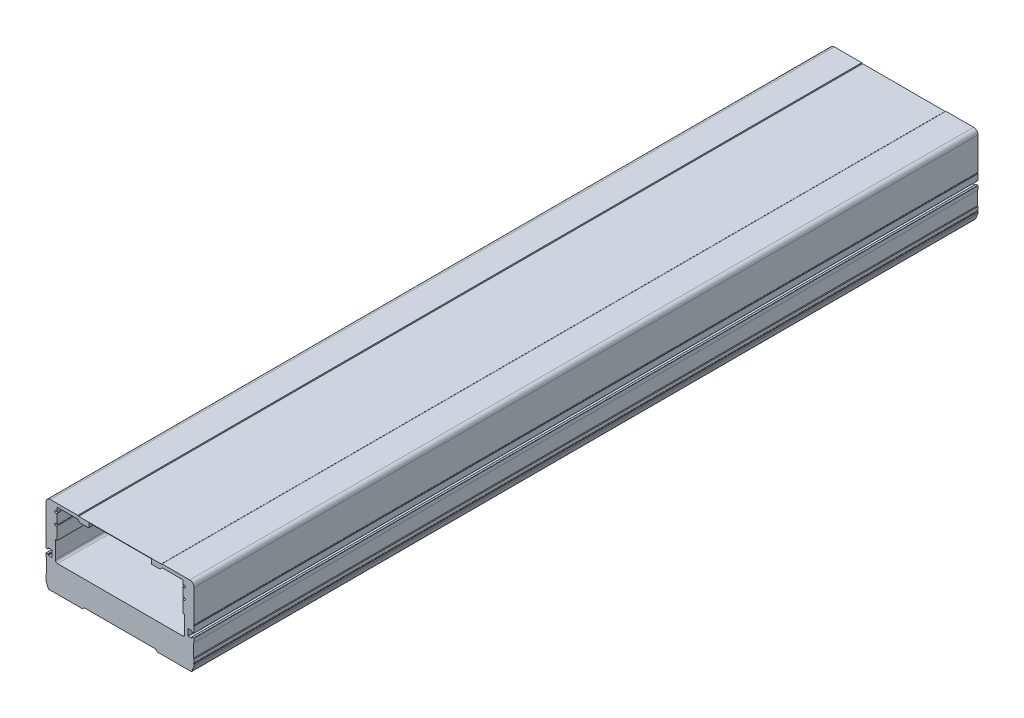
from build123d import *

# Parameters (mm, degrees)
EXTRUDE_1_DEPTH        = 715
HOLE_WIZARD_M6_1_D     = 5
HOLE_WIZARD_M6_1_DEPTH = 12
HOLE_WIZARD_M6_1_TIP   = 1.502151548


with BuildPart() as part:
    # Sketch 1 → Extrude 1 (new body)
    with BuildSketch(Plane.XY):
        with BuildLine():
            Line((-67.5, 66.1), (-67.5, 36.604669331))
            ThreePointArc((-67.5, 36.604669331), (-67.454950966, 36.446555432), (-67.3333333, 36.33592739))
            ThreePointArc((-67.3333333, 36.33592739), (-67.125, 35.999999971), (-67.333333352, 35.664072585))
            ThreePointArc((-67.333333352, 35.664072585), (-67.454950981, 35.553444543), (-67.5, 35.395330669))
            Line((-67.5, 35.395330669), (-67.5, 30.1))
            ThreePointArc((-67.5, 30.1), (-67.412132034, 29.887867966), (-67.2, 29.8))
            Line((-67.2, 29.8), (-65.8, 29.8))
            ThreePointArc((-65.8, 29.8), (-65.587867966, 29.887867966), (-65.5, 30.1))
            Line((-65.5, 30.1), (-65.5, 30.7))
            ThreePointArc((-65.5, 30.7), (-65.412132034, 30.912132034), (-65.2, 31))
            Line((-65.2, 31), (-62.3, 31))
            ThreePointArc((-62.3, 31), (-62.087867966, 30.912132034), (-62, 30.7))
            Line((-62, 30.7), (-62, 25.3))
            ThreePointArc((-62, 25.3), (-62.087867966, 25.087867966), (-62.3, 25))
            Line((-62.3, 25), (-65.2, 25))
            ThreePointArc((-65.2, 25), (-65.412132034, 25.087867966), (-65.5, 25.3))
            Line((-65.5, 25.3), (-65.5, 25.9))
            ThreePointArc((-65.5, 25.9), (-65.587867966, 26.112132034), (-65.8, 26.2))
            Line((-65.8, 26.2), (-67.2, 26.2))
            ThreePointArc((-67.2, 26.2), (-67.412132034, 26.112132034), (-67.5, 25.9))
            Line((-67.5, 25.9), (-67.5, 22.5))
            Line((-67.5, 22.5), (-67, 22))
            Line((-67, 22), (-67, 10))
            Line((-67, 10), (-67.5, 9.5))
            Line((-67.5, 9.5), (-67.5, 6.604669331))
            ThreePointArc((-67.5, 6.604669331), (-67.454950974, 6.446555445), (-67.333333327, 6.335927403))
            ThreePointArc((-67.333333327, 6.335927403), (-67.125, 5.999999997), (-67.333333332, 5.664072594))
            ThreePointArc((-67.333333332, 5.664072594), (-67.454950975, 5.553444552), (-67.5, 5.395330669))
            Line((-67.5, 5.395330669), (-67.5, 4.381968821))
            ThreePointArc((-67.5, 4.381968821), (-67.464493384, 4.00678121), (-67.359234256, 3.644915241))
            Line((-67.359234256, 3.644915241), (-65.506419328, -1.028852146))
            ThreePointArc((-65.506419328, -1.028852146), (-65.35722349, -1.328991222), (-65.16, -1.6))
            Line((-65.16, -1.6), (-34.1, -1.6))
            Line((-34.1, -1.6), (-32.5, 0))
            Line((-32.5, 0), (32.5, 0))
            Line((32.5, 0), (34.1, -1.6))
            Line((34.1, -1.6), (65.16, -1.6))
            ThreePointArc((65.16, -1.6), (65.35722349, -1.328991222), (65.506419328, -1.028852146))
            Line((65.506419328, -1.028852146), (67.359234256, 3.644915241))
            ThreePointArc((67.359234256, 3.644915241), (67.464493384, 4.00678121), (67.5, 4.381968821))
            Line((67.5, 4.381968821), (67.5, 5.395330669))
            ThreePointArc((67.5, 5.395330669), (67.454950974, 5.553444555), (67.333333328, 5.664072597))
            ThreePointArc((67.333333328, 5.664072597), (67.125, 6.000000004), (67.333333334, 6.335927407))
            ThreePointArc((67.333333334, 6.335927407), (67.454950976, 6.446555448), (67.5, 6.604669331))
            Line((67.5, 6.604669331), (67.5, 9.5))
            Line((67.5, 9.5), (67, 10))
            Line((67, 10), (67, 22))
            Line((67, 22), (67.5, 22.5))
            Line((67.5, 22.5), (67.5, 25.9))
            ThreePointArc((67.5, 25.9), (67.412132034, 26.112132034), (67.2, 26.2))
            Line((67.2, 26.2), (65.8, 26.2))
            ThreePointArc((65.8, 26.2), (65.587867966, 26.112132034), (65.5, 25.9))
            Line((65.5, 25.9), (65.5, 25.3))
            ThreePointArc((65.5, 25.3), (65.412132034, 25.087867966), (65.2, 25))
            Line((65.2, 25), (62.3, 25))
            ThreePointArc((62.3, 25), (62.087867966, 25.087867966), (62, 25.3))
            Line((62, 25.3), (62, 30.7))
            ThreePointArc((62, 30.7), (62.087867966, 30.912132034), (62.3, 31))
            Line((62.3, 31), (65.2, 31))
            ThreePointArc((65.2, 31), (65.412132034, 30.912132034), (65.5, 30.7))
            Line((65.5, 30.7), (65.5, 30.1))
            ThreePointArc((65.5, 30.1), (65.587867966, 29.887867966), (65.8, 29.8))
            Line((65.8, 29.8), (67.2, 29.8))
            ThreePointArc((67.2, 29.8), (67.412132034, 29.887867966), (67.5, 30.1))
            Line((67.5, 30.1), (67.5, 35.395330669))
            ThreePointArc((67.5, 35.395330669), (67.454950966, 35.553444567), (67.333333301, 35.66407261))
            ThreePointArc((67.333333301, 35.66407261), (67.125, 36.000000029), (67.333333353, 36.335927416))
            ThreePointArc((67.333333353, 36.335927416), (67.454950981, 36.446555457), (67.5, 36.604669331))
            Line((67.5, 36.604669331), (67.5, 66.1))
            ThreePointArc((67.5, 66.1), (66.328427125, 68.928427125), (63.5, 70.1))
            Line((63.5, 70.1), (38.5, 70.1))
            Line((38.5, 70.1), (38, 69.6))
            Line((38, 69.6), (37.5, 69.6))
            Line((37.5, 69.6), (37.5, 69.7))
            Line((37.5, 69.7), (-37.5, 69.7))
            Line((-37.5, 69.7), (-37.5, 69.6))
            Line((-37.5, 69.6), (-38, 69.6))
            Line((-38, 69.6), (-38.5, 70.1))
            Line((-38.5, 70.1), (-63.5, 70.1))
            ThreePointArc((-63.5, 70.1), (-66.328427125, 68.928427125), (-67.5, 66.1))
        make_face()
        with BuildLine():
            Line((-57, 22.7), (57, 22.7))
            ThreePointArc((57, 22.7), (58.414213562, 23.285786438), (59, 24.7))
            Line((59, 24.7), (59, 40.6))
            Line((59, 40.6), (57.5, 40.6))
            Line((57.5, 40.6), (57.5, 52.141742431))
            ThreePointArc((57.5, 52.141742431), (59.6, 52.6), (57.5, 53.058257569))
            Line((57.5, 53.058257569), (57.5, 62.141742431))
            ThreePointArc((57.5, 62.141742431), (59.6, 62.6), (57.5, 63.058257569))
            Line((57.5, 63.058257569), (57.5, 66.1))
            ThreePointArc((57.5, 66.1), (57.207106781, 66.807106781), (56.5, 67.1))
            Line((56.5, 67.1), (38.5, 67.1))
            Line((38.5, 67.1), (36.5, 65.1))
            Line((36.5, 65.1), (28.8, 65.1))
            ThreePointArc((28.8, 65.1), (28.587867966, 65.187867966), (28.5, 65.4))
            Line((28.5, 65.4), (28.5, 69.3))
            Line((28.5, 69.3), (-28.5, 69.3))
            Line((-28.5, 69.3), (-28.5, 65.4))
            ThreePointArc((-28.5, 65.4), (-28.587867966, 65.187867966), (-28.8, 65.1))
            Line((-28.8, 65.1), (-36.5, 65.1))
            Line((-36.5, 65.1), (-38.5, 67.1))
            Line((-38.5, 67.1), (-56.5, 67.1))
            ThreePointArc((-56.5, 67.1), (-57.207106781, 66.807106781), (-57.5, 66.1))
            Line((-57.5, 66.1), (-57.5, 63.058257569))
            ThreePointArc((-57.5, 63.058257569), (-59.6, 62.6), (-57.5, 62.141742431))
            Line((-57.5, 62.141742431), (-57.5, 53.058257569))
            ThreePointArc((-57.5, 53.058257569), (-59.6, 52.6), (-57.5, 52.141742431))
            Line((-57.5, 52.141742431), (-57.5, 40.6))
            Line((-57.5, 40.6), (-59.3, 40.6))
            ThreePointArc((-59.3, 40.6), (-59.087867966, 40.512132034), (-59, 40.3))
            Line((-59, 40.3), (-59, 24.7))
            ThreePointArc((-59, 24.7), (-58.414213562, 23.285786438), (-57, 22.7))
        make_face(mode=Mode.SUBTRACT)
    extrude(amount=EXTRUDE_1_DEPTH)

    # Hole Wizard M6 _1
    with Locations(Plane(origin=(0, -1.6, 0), x_dir=(-1, 0, 0), z_dir=(0, -1, 0))):
        with Locations((53, -663.5), (-53, -663.5), (53, -613.5), (53, -413.5), (53, -213.5), (53, -13.5), (53, 186.5), (53, 386.5), (-53, 186.5), (-53, -13.5), (-53, -213.5), (-53, -413.5), (-53, -613.5)):
            Hole(HOLE_WIZARD_M6_1_D / 2, depth=HOLE_WIZARD_M6_1_DEPTH)
            with Locations((0, 0, -(HOLE_WIZARD_M6_1_DEPTH + HOLE_WIZARD_M6_1_TIP / 2))):  # 118° drill point
                Cone(0, HOLE_WIZARD_M6_1_D / 2, HOLE_WIZARD_M6_1_TIP, mode=Mode.SUBTRACT)


solid = part.part
